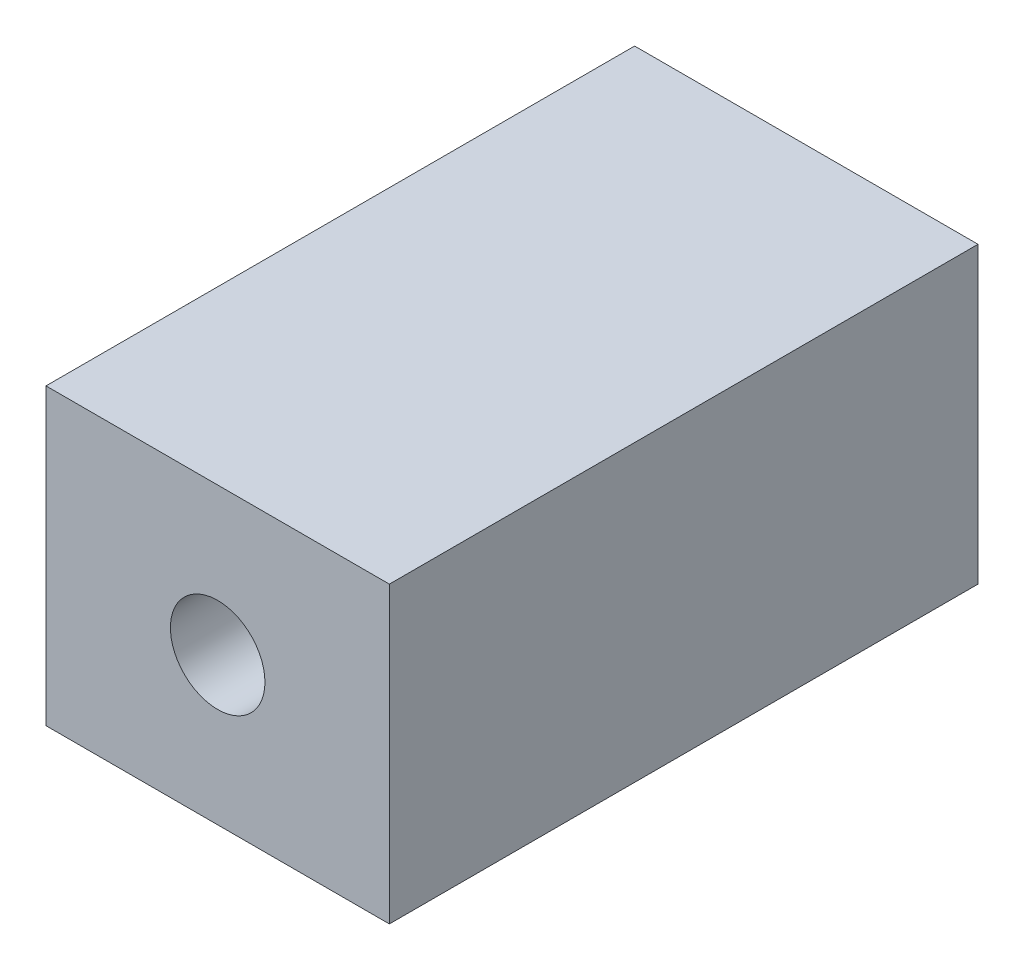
ISO-10303-21;
HEADER;
FILE_DESCRIPTION(('STEP AP214'),'2;1');
FILE_NAME('part.step','',(''),(''),'','','');
FILE_SCHEMA(('AUTOMOTIVE_DESIGN { 1 0 10303 214 1 1 1 1 }'));
ENDSEC;
DATA;
#1=APPLICATION_CONTEXT('core data for automotive mechanical design processes');
#2=APPLICATION_PROTOCOL_DEFINITION('international standard','automotive_design',2000,#1);
#3=PRODUCT_CONTEXT('',#1,'mechanical');
#4=PRODUCT('Part','Part','',(#3));
#5=PRODUCT_RELATED_PRODUCT_CATEGORY('part','',(#4));
#6=PRODUCT_DEFINITION_FORMATION('','',#4);
#7=PRODUCT_DEFINITION_CONTEXT('part definition',#1,'design');
#8=PRODUCT_DEFINITION('design','',#6,#7);
#9=PRODUCT_DEFINITION_SHAPE('','',#8);
#10=(LENGTH_UNIT() NAMED_UNIT(*) SI_UNIT(.MILLI.,.METRE.));
#11=(NAMED_UNIT(*) PLANE_ANGLE_UNIT() SI_UNIT($,.RADIAN.));
#12=(NAMED_UNIT(*) SI_UNIT($,.STERADIAN.) SOLID_ANGLE_UNIT());
#13=UNCERTAINTY_MEASURE_WITH_UNIT(LENGTH_MEASURE(1.E-05),#10,'distance_accuracy_value','');
#14=(GEOMETRIC_REPRESENTATION_CONTEXT(3) GLOBAL_UNCERTAINTY_ASSIGNED_CONTEXT((#13)) GLOBAL_UNIT_ASSIGNED_CONTEXT((#10,
#11,#12)) REPRESENTATION_CONTEXT('',''));
#15=CARTESIAN_POINT('',(0.,0.,0.));
#16=DIRECTION('',(0.,0.,1.));
#17=DIRECTION('',(1.,0.,0.));
#18=AXIS2_PLACEMENT_3D('',#15,#16,#17);
#19=CARTESIAN_POINT('',(-3.5,3.,-6.));
#20=DIRECTION('',(1.,0.,0.));
#21=DIRECTION('',(0.,0.,-1.));
#22=AXIS2_PLACEMENT_3D('',#19,#20,#21);
#23=PLANE('',#22);
#24=DIRECTION('',(0.,0.,1.));
#25=VECTOR('',#24,1.);
#26=CARTESIAN_POINT('',(-3.5,-3.,-6.));
#27=LINE('',#26,#25);
#28=CARTESIAN_POINT('',(-3.5,-3.,-6.));
#29=VERTEX_POINT('',#28);
#30=CARTESIAN_POINT('',(-3.5,-3.,6.));
#31=VERTEX_POINT('',#30);
#32=EDGE_CURVE('E98',#29,#31,#27,.T.);
#33=ORIENTED_EDGE('',*,*,#32,.T.);
#34=DIRECTION('',(0.,-1.,0.));
#35=VECTOR('',#34,1.);
#36=CARTESIAN_POINT('',(-3.5,3.,6.));
#37=LINE('',#36,#35);
#38=CARTESIAN_POINT('',(-3.5,3.,6.));
#39=VERTEX_POINT('',#38);
#40=EDGE_CURVE('E11',#39,#31,#37,.T.);
#41=ORIENTED_EDGE('',*,*,#40,.F.);
#42=DIRECTION('',(0.,0.,1.));
#43=VECTOR('',#42,1.);
#44=CARTESIAN_POINT('',(-3.5,3.,-6.));
#45=LINE('',#44,#43);
#46=CARTESIAN_POINT('',(-3.5,3.,-6.));
#47=VERTEX_POINT('',#46);
#48=EDGE_CURVE('E86',#47,#39,#45,.T.);
#49=ORIENTED_EDGE('',*,*,#48,.F.);
#50=DIRECTION('',(0.,-1.,0.));
#51=VECTOR('',#50,1.);
#52=CARTESIAN_POINT('',(-3.5,3.,-6.));
#53=LINE('',#52,#51);
#54=EDGE_CURVE('E94',#47,#29,#53,.T.);
#55=ORIENTED_EDGE('',*,*,#54,.T.);
#56=EDGE_LOOP('',(#33,#41,#49,#55));
#57=FACE_BOUND('',#56,.T.);
#58=ADVANCED_FACE('F35',(#57),#23,.F.);
#59=CARTESIAN_POINT('',(-3.5,3.,6.));
#60=DIRECTION('',(0.,0.,-1.));
#61=DIRECTION('',(-1.,0.,0.));
#62=AXIS2_PLACEMENT_3D('',#59,#60,#61);
#63=PLANE('',#62);
#64=CARTESIAN_POINT('',(0.,0.,6.));
#65=DIRECTION('',(0.,0.,1.));
#66=DIRECTION('',(1.,0.,0.));
#67=AXIS2_PLACEMENT_3D('',#64,#65,#66);
#68=CIRCLE('',#67,0.963531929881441);
#69=CARTESIAN_POINT('',(0.963531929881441,0.,6.));
#70=VERTEX_POINT('',#69);
#71=EDGE_CURVE('E101',#70,#70,#68,.T.);
#72=ORIENTED_EDGE('',*,*,#71,.F.);
#73=EDGE_LOOP('',(#72));
#74=FACE_BOUND('',#73,.T.);
#75=DIRECTION('',(1.,0.,0.));
#76=VECTOR('',#75,1.);
#77=CARTESIAN_POINT('',(-3.5,-3.,6.));
#78=LINE('',#77,#76);
#79=CARTESIAN_POINT('',(3.5,-3.,6.));
#80=VERTEX_POINT('',#79);
#81=EDGE_CURVE('E90',#31,#80,#78,.T.);
#82=ORIENTED_EDGE('',*,*,#81,.T.);
#83=DIRECTION('',(0.,-1.,0.));
#84=VECTOR('',#83,1.);
#85=CARTESIAN_POINT('',(3.5,3.,6.));
#86=LINE('',#85,#84);
#87=CARTESIAN_POINT('',(3.5,3.,6.));
#88=VERTEX_POINT('',#87);
#89=EDGE_CURVE('E43',#88,#80,#86,.T.);
#90=ORIENTED_EDGE('',*,*,#89,.F.);
#91=DIRECTION('',(1.,0.,0.));
#92=VECTOR('',#91,1.);
#93=CARTESIAN_POINT('',(-3.5,3.,6.));
#94=LINE('',#93,#92);
#95=EDGE_CURVE('E81',#39,#88,#94,.T.);
#96=ORIENTED_EDGE('',*,*,#95,.F.);
#97=ORIENTED_EDGE('',*,*,#40,.T.);
#98=EDGE_LOOP('',(#82,#90,#96,#97));
#99=FACE_BOUND('',#98,.T.);
#100=ADVANCED_FACE('F89',(#74,#99),#63,.F.);
#101=CARTESIAN_POINT('',(3.5,3.,-6.));
#102=DIRECTION('',(-1.,0.,0.));
#103=DIRECTION('',(0.,0.,1.));
#104=AXIS2_PLACEMENT_3D('',#101,#102,#103);
#105=PLANE('',#104);
#106=DIRECTION('',(0.,0.,-1.));
#107=VECTOR('',#106,1.);
#108=CARTESIAN_POINT('',(3.5,-3.,-6.));
#109=LINE('',#108,#107);
#110=CARTESIAN_POINT('',(3.5,-3.,-6.));
#111=VERTEX_POINT('',#110);
#112=EDGE_CURVE('E68',#80,#111,#109,.T.);
#113=ORIENTED_EDGE('',*,*,#112,.T.);
#114=DIRECTION('',(0.,-1.,0.));
#115=VECTOR('',#114,1.);
#116=CARTESIAN_POINT('',(3.5,3.,-6.));
#117=LINE('',#116,#115);
#118=CARTESIAN_POINT('',(3.5,3.,-6.));
#119=VERTEX_POINT('',#118);
#120=EDGE_CURVE('E91',#119,#111,#117,.T.);
#121=ORIENTED_EDGE('',*,*,#120,.F.);
#122=DIRECTION('',(0.,0.,-1.));
#123=VECTOR('',#122,1.);
#124=CARTESIAN_POINT('',(3.5,3.,-6.));
#125=LINE('',#124,#123);
#126=EDGE_CURVE('E84',#88,#119,#125,.T.);
#127=ORIENTED_EDGE('',*,*,#126,.F.);
#128=ORIENTED_EDGE('',*,*,#89,.T.);
#129=EDGE_LOOP('',(#113,#121,#127,#128));
#130=FACE_BOUND('',#129,.T.);
#131=ADVANCED_FACE('F92',(#130),#105,.F.);
#132=CARTESIAN_POINT('',(-3.5,3.,-6.));
#133=DIRECTION('',(0.,0.,1.));
#134=DIRECTION('',(1.,0.,0.));
#135=AXIS2_PLACEMENT_3D('',#132,#133,#134);
#136=PLANE('',#135);
#137=CARTESIAN_POINT('',(0.,0.,-6.));
#138=DIRECTION('',(0.,0.,1.));
#139=DIRECTION('',(1.,0.,0.));
#140=AXIS2_PLACEMENT_3D('',#137,#138,#139);
#141=CIRCLE('',#140,1.16748720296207);
#142=CARTESIAN_POINT('',(1.16748720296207,0.,-6.));
#143=VERTEX_POINT('',#142);
#144=EDGE_CURVE('E117',#143,#143,#141,.T.);
#145=ORIENTED_EDGE('',*,*,#144,.T.);
#146=EDGE_LOOP('',(#145));
#147=FACE_BOUND('',#146,.T.);
#148=DIRECTION('',(-1.,0.,0.));
#149=VECTOR('',#148,1.);
#150=CARTESIAN_POINT('',(-3.5,-3.,-6.));
#151=LINE('',#150,#149);
#152=EDGE_CURVE('E74',#111,#29,#151,.T.);
#153=ORIENTED_EDGE('',*,*,#152,.T.);
#154=ORIENTED_EDGE('',*,*,#54,.F.);
#155=DIRECTION('',(-1.,0.,0.));
#156=VECTOR('',#155,1.);
#157=CARTESIAN_POINT('',(-3.5,3.,-6.));
#158=LINE('',#157,#156);
#159=EDGE_CURVE('E51',#119,#47,#158,.T.);
#160=ORIENTED_EDGE('',*,*,#159,.F.);
#161=ORIENTED_EDGE('',*,*,#120,.T.);
#162=EDGE_LOOP('',(#153,#154,#160,#161));
#163=FACE_BOUND('',#162,.T.);
#164=ADVANCED_FACE('F106',(#147,#163),#136,.F.);
#165=CARTESIAN_POINT('',(0.,3.,0.));
#166=DIRECTION('',(0.,1.,0.));
#167=DIRECTION('',(0.,0.,1.));
#168=AXIS2_PLACEMENT_3D('',#165,#166,#167);
#169=PLANE('',#168);
#170=ORIENTED_EDGE('',*,*,#48,.T.);
#171=ORIENTED_EDGE('',*,*,#95,.T.);
#172=ORIENTED_EDGE('',*,*,#126,.T.);
#173=ORIENTED_EDGE('',*,*,#159,.T.);
#174=EDGE_LOOP('',(#170,#171,#172,#173));
#175=FACE_BOUND('',#174,.T.);
#176=ADVANCED_FACE('F82',(#175),#169,.T.);
#177=CARTESIAN_POINT('',(0.,-3.,0.));
#178=DIRECTION('',(0.,1.,0.));
#179=DIRECTION('',(0.,0.,1.));
#180=AXIS2_PLACEMENT_3D('',#177,#178,#179);
#181=PLANE('',#180);
#182=ORIENTED_EDGE('',*,*,#32,.F.);
#183=ORIENTED_EDGE('',*,*,#152,.F.);
#184=ORIENTED_EDGE('',*,*,#112,.F.);
#185=ORIENTED_EDGE('',*,*,#81,.F.);
#186=EDGE_LOOP('',(#182,#183,#184,#185));
#187=FACE_BOUND('',#186,.T.);
#188=ADVANCED_FACE('F109',(#187),#181,.F.);
#189=CARTESIAN_POINT('',(0.,0.,6.));
#190=DIRECTION('',(0.,0.,-1.));
#191=DIRECTION('',(-1.,0.,0.));
#192=AXIS2_PLACEMENT_3D('',#189,#190,#191);
#193=CYLINDRICAL_SURFACE('',#192,0.963531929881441);
#194=ORIENTED_EDGE('',*,*,#71,.T.);
#195=EDGE_LOOP('',(#194));
#196=FACE_BOUND('',#195,.T.);
#197=CARTESIAN_POINT('',(0.,0.,0.));
#198=DIRECTION('',(0.,0.,1.));
#199=DIRECTION('',(1.,0.,0.));
#200=AXIS2_PLACEMENT_3D('',#197,#198,#199);
#201=CIRCLE('',#200,0.963531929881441);
#202=CARTESIAN_POINT('',(0.963531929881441,0.,0.));
#203=VERTEX_POINT('',#202);
#204=EDGE_CURVE('E114',#203,#203,#201,.T.);
#205=ORIENTED_EDGE('',*,*,#204,.F.);
#206=EDGE_LOOP('',(#205));
#207=FACE_BOUND('',#206,.T.);
#208=ADVANCED_FACE('F129',(#196,#207),#193,.F.);
#209=CARTESIAN_POINT('',(0.,0.,-6.));
#210=DIRECTION('',(0.,0.,1.));
#211=DIRECTION('',(1.,0.,0.));
#212=AXIS2_PLACEMENT_3D('',#209,#210,#211);
#213=CYLINDRICAL_SURFACE('',#212,1.16748720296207);
#214=ORIENTED_EDGE('',*,*,#144,.F.);
#215=EDGE_LOOP('',(#214));
#216=FACE_BOUND('',#215,.T.);
#217=CARTESIAN_POINT('',(0.,0.,0.));
#218=DIRECTION('',(0.,0.,1.));
#219=DIRECTION('',(1.,0.,0.));
#220=AXIS2_PLACEMENT_3D('',#217,#218,#219);
#221=CIRCLE('',#220,1.16748720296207);
#222=CARTESIAN_POINT('',(1.16748720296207,0.,0.));
#223=VERTEX_POINT('',#222);
#224=EDGE_CURVE('E118',#223,#223,#221,.T.);
#225=ORIENTED_EDGE('',*,*,#224,.T.);
#226=EDGE_LOOP('',(#225));
#227=FACE_BOUND('',#226,.T.);
#228=ADVANCED_FACE('F125',(#216,#227),#213,.F.);
#229=CARTESIAN_POINT('',(0.,0.,0.));
#230=DIRECTION('',(0.,0.,1.));
#231=DIRECTION('',(1.,0.,0.));
#232=AXIS2_PLACEMENT_3D('',#229,#230,#231);
#233=PLANE('',#232);
#234=ORIENTED_EDGE('',*,*,#204,.T.);
#235=EDGE_LOOP('',(#234));
#236=FACE_BOUND('',#235,.T.);
#237=ORIENTED_EDGE('',*,*,#224,.F.);
#238=EDGE_LOOP('',(#237));
#239=FACE_BOUND('',#238,.T.);
#240=ADVANCED_FACE('F128',(#236,#239),#233,.F.);
#241=CLOSED_SHELL('',(#58,#100,#131,#164,#176,#188,#208,#228,#240));
#242=MANIFOLD_SOLID_BREP('B2',#241);
#243=ADVANCED_BREP_SHAPE_REPRESENTATION('',(#18,#242),#14);
#244=SHAPE_DEFINITION_REPRESENTATION(#9,#243);
ENDSEC;
END-ISO-10303-21;
